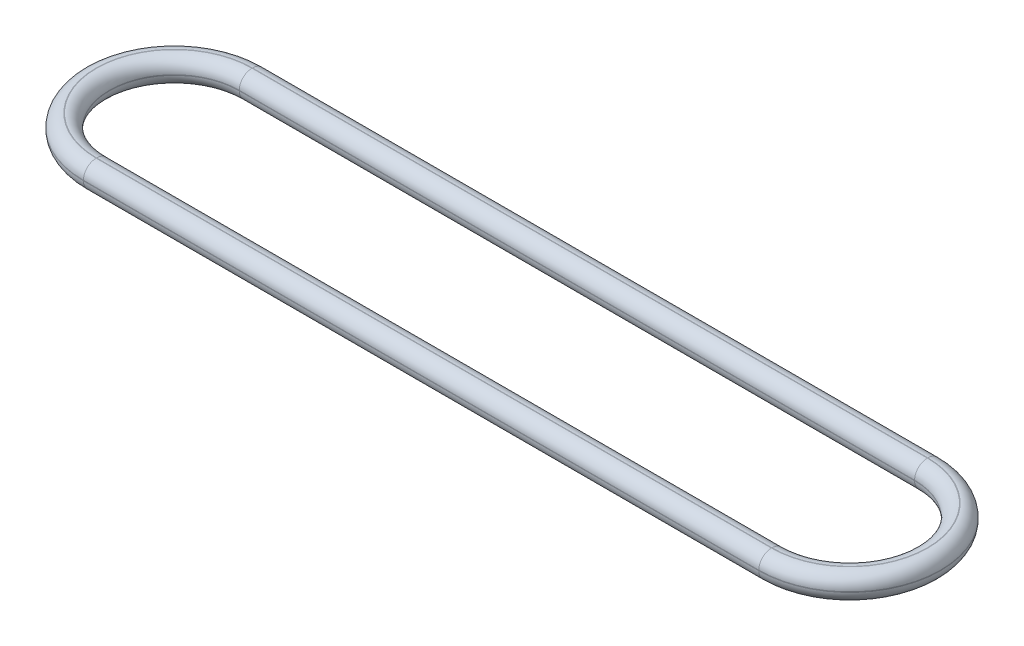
ISO-10303-21;
HEADER;
FILE_DESCRIPTION(('STEP AP214'),'2;1');
FILE_NAME('part.step','',(''),(''),'','','');
FILE_SCHEMA(('AUTOMOTIVE_DESIGN { 1 0 10303 214 1 1 1 1 }'));
ENDSEC;
DATA;
#1=APPLICATION_CONTEXT('core data for automotive mechanical design processes');
#2=APPLICATION_PROTOCOL_DEFINITION('international standard','automotive_design',2000,#1);
#3=PRODUCT_CONTEXT('',#1,'mechanical');
#4=PRODUCT('Part','Part','',(#3));
#5=PRODUCT_RELATED_PRODUCT_CATEGORY('part','',(#4));
#6=PRODUCT_DEFINITION_FORMATION('','',#4);
#7=PRODUCT_DEFINITION_CONTEXT('part definition',#1,'design');
#8=PRODUCT_DEFINITION('design','',#6,#7);
#9=PRODUCT_DEFINITION_SHAPE('','',#8);
#10=(LENGTH_UNIT() NAMED_UNIT(*) SI_UNIT(.MILLI.,.METRE.));
#11=(NAMED_UNIT(*) PLANE_ANGLE_UNIT() SI_UNIT($,.RADIAN.));
#12=(NAMED_UNIT(*) SI_UNIT($,.STERADIAN.) SOLID_ANGLE_UNIT());
#13=UNCERTAINTY_MEASURE_WITH_UNIT(LENGTH_MEASURE(1.E-05),#10,'distance_accuracy_value','');
#14=(GEOMETRIC_REPRESENTATION_CONTEXT(3) GLOBAL_UNCERTAINTY_ASSIGNED_CONTEXT((#13)) GLOBAL_UNIT_ASSIGNED_CONTEXT((#10,
#11,#12)) REPRESENTATION_CONTEXT('',''));
#15=CARTESIAN_POINT('',(0.,0.,0.));
#16=DIRECTION('',(0.,0.,1.));
#17=DIRECTION('',(1.,0.,0.));
#18=AXIS2_PLACEMENT_3D('',#15,#16,#17);
#19=CARTESIAN_POINT('',(0.,1.,0.));
#20=DIRECTION('',(0.,1.,0.));
#21=DIRECTION('',(0.,0.,1.));
#22=AXIS2_PLACEMENT_3D('',#19,#20,#21);
#23=PLANE('',#22);
#24=DIRECTION('',(-1.,0.,0.));
#25=VECTOR('',#24,1.);
#26=CARTESIAN_POINT('',(0.,1.,-2.99));
#27=LINE('',#26,#25);
#28=CARTESIAN_POINT('',(0.,1.,-2.99));
#29=VERTEX_POINT('',#28);
#30=CARTESIAN_POINT('',(26.,1.,-2.99));
#31=VERTEX_POINT('',#30);
#32=EDGE_CURVE('E52',#29,#31,#27,.F.);
#33=ORIENTED_EDGE('',*,*,#32,.T.);
#34=CARTESIAN_POINT('',(26.,1.,0.));
#35=DIRECTION('',(0.,1.,0.));
#36=DIRECTION('',(0.,0.,1.));
#37=AXIS2_PLACEMENT_3D('',#34,#35,#36);
#38=CIRCLE('',#37,2.99);
#39=CARTESIAN_POINT('',(26.,1.,2.99));
#40=VERTEX_POINT('',#39);
#41=EDGE_CURVE('E237',#31,#40,#38,.F.);
#42=ORIENTED_EDGE('',*,*,#41,.T.);
#43=DIRECTION('',(1.,0.,0.));
#44=VECTOR('',#43,1.);
#45=CARTESIAN_POINT('',(0.,1.,2.99));
#46=LINE('',#45,#44);
#47=CARTESIAN_POINT('',(0.,1.,2.99));
#48=VERTEX_POINT('',#47);
#49=EDGE_CURVE('E233',#40,#48,#46,.F.);
#50=ORIENTED_EDGE('',*,*,#49,.T.);
#51=CARTESIAN_POINT('',(0.,1.,0.));
#52=DIRECTION('',(0.,1.,0.));
#53=DIRECTION('',(0.,0.,1.));
#54=AXIS2_PLACEMENT_3D('',#51,#52,#53);
#55=CIRCLE('',#54,2.99);
#56=EDGE_CURVE('E57',#48,#29,#55,.F.);
#57=ORIENTED_EDGE('',*,*,#56,.T.);
#58=EDGE_LOOP('',(#33,#42,#50,#57));
#59=FACE_BOUND('',#58,.T.);
#60=CARTESIAN_POINT('',(26.,1.,0.));
#61=DIRECTION('',(0.,1.,0.));
#62=DIRECTION('',(0.,0.,1.));
#63=AXIS2_PLACEMENT_3D('',#60,#61,#62);
#64=CIRCLE('',#63,3.01);
#65=CARTESIAN_POINT('',(26.,1.,3.01000000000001));
#66=VERTEX_POINT('',#65);
#67=CARTESIAN_POINT('',(26.,1.,-3.01));
#68=VERTEX_POINT('',#67);
#69=EDGE_CURVE('E228',#66,#68,#64,.T.);
#70=ORIENTED_EDGE('',*,*,#69,.T.);
#71=DIRECTION('',(-1.,0.,0.));
#72=VECTOR('',#71,1.);
#73=CARTESIAN_POINT('',(0.,1.,-3.01));
#74=LINE('',#73,#72);
#75=CARTESIAN_POINT('',(0.,1.,-3.01));
#76=VERTEX_POINT('',#75);
#77=EDGE_CURVE('E230',#68,#76,#74,.T.);
#78=ORIENTED_EDGE('',*,*,#77,.T.);
#79=CARTESIAN_POINT('',(0.,1.,0.));
#80=DIRECTION('',(0.,1.,0.));
#81=DIRECTION('',(0.,0.,1.));
#82=AXIS2_PLACEMENT_3D('',#79,#80,#81);
#83=CIRCLE('',#82,3.01);
#84=CARTESIAN_POINT('',(0.,1.,3.01));
#85=VERTEX_POINT('',#84);
#86=EDGE_CURVE('E224',#76,#85,#83,.T.);
#87=ORIENTED_EDGE('',*,*,#86,.T.);
#88=DIRECTION('',(1.,0.,0.));
#89=VECTOR('',#88,1.);
#90=CARTESIAN_POINT('',(26.,1.,3.01000000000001));
#91=LINE('',#90,#89);
#92=EDGE_CURVE('E226',#85,#66,#91,.T.);
#93=ORIENTED_EDGE('',*,*,#92,.T.);
#94=EDGE_LOOP('',(#70,#78,#87,#93));
#95=FACE_BOUND('',#94,.T.);
#96=ADVANCED_FACE('F35',(#59,#95),#23,.T.);
#97=CARTESIAN_POINT('',(0.,0.,0.));
#98=DIRECTION('',(0.,1.,0.));
#99=DIRECTION('',(0.,0.,1.));
#100=AXIS2_PLACEMENT_3D('',#97,#98,#99);
#101=PLANE('',#100);
#102=DIRECTION('',(-1.,0.,0.));
#103=VECTOR('',#102,1.);
#104=CARTESIAN_POINT('',(0.,0.,-2.99));
#105=LINE('',#104,#103);
#106=CARTESIAN_POINT('',(26.,0.,-2.99));
#107=VERTEX_POINT('',#106);
#108=CARTESIAN_POINT('',(0.,0.,-2.99));
#109=VERTEX_POINT('',#108);
#110=EDGE_CURVE('E188',#107,#109,#105,.T.);
#111=ORIENTED_EDGE('',*,*,#110,.T.);
#112=CARTESIAN_POINT('',(0.,0.,0.));
#113=DIRECTION('',(0.,1.,0.));
#114=DIRECTION('',(0.,0.,1.));
#115=AXIS2_PLACEMENT_3D('',#112,#113,#114);
#116=CIRCLE('',#115,2.99);
#117=CARTESIAN_POINT('',(0.,0.,2.99));
#118=VERTEX_POINT('',#117);
#119=EDGE_CURVE('E190',#109,#118,#116,.T.);
#120=ORIENTED_EDGE('',*,*,#119,.T.);
#121=DIRECTION('',(1.,0.,0.));
#122=VECTOR('',#121,1.);
#123=CARTESIAN_POINT('',(26.,0.,2.99));
#124=LINE('',#123,#122);
#125=CARTESIAN_POINT('',(26.,0.,2.99));
#126=VERTEX_POINT('',#125);
#127=EDGE_CURVE('E184',#118,#126,#124,.T.);
#128=ORIENTED_EDGE('',*,*,#127,.T.);
#129=CARTESIAN_POINT('',(26.,0.,0.));
#130=DIRECTION('',(0.,1.,0.));
#131=DIRECTION('',(0.,0.,1.));
#132=AXIS2_PLACEMENT_3D('',#129,#130,#131);
#133=CIRCLE('',#132,2.99);
#134=EDGE_CURVE('E186',#126,#107,#133,.T.);
#135=ORIENTED_EDGE('',*,*,#134,.T.);
#136=EDGE_LOOP('',(#111,#120,#128,#135));
#137=FACE_BOUND('',#136,.T.);
#138=CARTESIAN_POINT('',(26.,0.,0.));
#139=DIRECTION('',(0.,1.,0.));
#140=DIRECTION('',(0.,0.,1.));
#141=AXIS2_PLACEMENT_3D('',#138,#139,#140);
#142=CIRCLE('',#141,3.01);
#143=CARTESIAN_POINT('',(26.,0.,-3.01));
#144=VERTEX_POINT('',#143);
#145=CARTESIAN_POINT('',(26.,0.,3.01000000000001));
#146=VERTEX_POINT('',#145);
#147=EDGE_CURVE('E153',#144,#146,#142,.F.);
#148=ORIENTED_EDGE('',*,*,#147,.T.);
#149=DIRECTION('',(1.,0.,0.));
#150=VECTOR('',#149,1.);
#151=CARTESIAN_POINT('',(0.,0.,3.01));
#152=LINE('',#151,#150);
#153=CARTESIAN_POINT('',(0.,0.,3.01));
#154=VERTEX_POINT('',#153);
#155=EDGE_CURVE('E182',#146,#154,#152,.F.);
#156=ORIENTED_EDGE('',*,*,#155,.T.);
#157=CARTESIAN_POINT('',(0.,0.,0.));
#158=DIRECTION('',(0.,1.,0.));
#159=DIRECTION('',(0.,0.,1.));
#160=AXIS2_PLACEMENT_3D('',#157,#158,#159);
#161=CIRCLE('',#160,3.01);
#162=CARTESIAN_POINT('',(0.,0.,-3.01));
#163=VERTEX_POINT('',#162);
#164=EDGE_CURVE('E156',#154,#163,#161,.F.);
#165=ORIENTED_EDGE('',*,*,#164,.T.);
#166=DIRECTION('',(-1.,0.,0.));
#167=VECTOR('',#166,1.);
#168=CARTESIAN_POINT('',(0.,0.,-3.01));
#169=LINE('',#168,#167);
#170=EDGE_CURVE('E148',#163,#144,#169,.F.);
#171=ORIENTED_EDGE('',*,*,#170,.T.);
#172=EDGE_LOOP('',(#148,#156,#165,#171));
#173=FACE_BOUND('',#172,.T.);
#174=ADVANCED_FACE('F150',(#137,#173),#101,.F.);
#175=CARTESIAN_POINT('',(0.,1.,0.));
#176=DIRECTION('',(0.,-1.,0.));
#177=DIRECTION('',(0.,0.,-1.));
#178=AXIS2_PLACEMENT_3D('',#175,#176,#177);
#179=CYLINDRICAL_SURFACE('',#178,3.5);
#180=DIRECTION('',(0.,-1.,0.));
#181=VECTOR('',#180,1.);
#182=CARTESIAN_POINT('',(0.,1.,-3.5));
#183=LINE('',#182,#181);
#184=CARTESIAN_POINT('',(0.,0.51,-3.5));
#185=VERTEX_POINT('',#184);
#186=CARTESIAN_POINT('',(0.,0.49,-3.5));
#187=VERTEX_POINT('',#186);
#188=EDGE_CURVE('E294',#185,#187,#183,.T.);
#189=ORIENTED_EDGE('',*,*,#188,.T.);
#190=CARTESIAN_POINT('',(0.,0.49,0.));
#191=DIRECTION('',(0.,1.,0.));
#192=DIRECTION('',(0.,0.,1.));
#193=AXIS2_PLACEMENT_3D('',#190,#191,#192);
#194=CIRCLE('',#193,3.5);
#195=CARTESIAN_POINT('',(0.,0.49,3.5));
#196=VERTEX_POINT('',#195);
#197=EDGE_CURVE('E214',#187,#196,#194,.T.);
#198=ORIENTED_EDGE('',*,*,#197,.T.);
#199=DIRECTION('',(0.,-1.,0.));
#200=VECTOR('',#199,1.);
#201=CARTESIAN_POINT('',(0.,1.,3.5));
#202=LINE('',#201,#200);
#203=CARTESIAN_POINT('',(0.,0.51,3.5));
#204=VERTEX_POINT('',#203);
#205=EDGE_CURVE('E174',#204,#196,#202,.T.);
#206=ORIENTED_EDGE('',*,*,#205,.F.);
#207=CARTESIAN_POINT('',(0.,0.51,0.));
#208=DIRECTION('',(0.,1.,0.));
#209=DIRECTION('',(0.,0.,1.));
#210=AXIS2_PLACEMENT_3D('',#207,#208,#209);
#211=CIRCLE('',#210,3.5);
#212=EDGE_CURVE('E212',#204,#185,#211,.F.);
#213=ORIENTED_EDGE('',*,*,#212,.T.);
#214=EDGE_LOOP('',(#189,#198,#206,#213));
#215=FACE_BOUND('',#214,.T.);
#216=ADVANCED_FACE('F291',(#215),#179,.T.);
#217=CARTESIAN_POINT('',(26.,1.,3.50000000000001));
#218=DIRECTION('',(0.,0.,-1.));
#219=DIRECTION('',(-1.,0.,0.));
#220=AXIS2_PLACEMENT_3D('',#217,#218,#219);
#221=PLANE('',#220);
#222=ORIENTED_EDGE('',*,*,#205,.T.);
#223=DIRECTION('',(1.,0.,0.));
#224=VECTOR('',#223,1.);
#225=CARTESIAN_POINT('',(26.,0.49,3.50000000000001));
#226=LINE('',#225,#224);
#227=CARTESIAN_POINT('',(26.,0.49,3.50000000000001));
#228=VERTEX_POINT('',#227);
#229=EDGE_CURVE('E209',#196,#228,#226,.T.);
#230=ORIENTED_EDGE('',*,*,#229,.T.);
#231=DIRECTION('',(0.,-1.,0.));
#232=VECTOR('',#231,1.);
#233=CARTESIAN_POINT('',(26.,1.,3.50000000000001));
#234=LINE('',#233,#232);
#235=CARTESIAN_POINT('',(26.,0.51,3.50000000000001));
#236=VERTEX_POINT('',#235);
#237=EDGE_CURVE('E177',#236,#228,#234,.T.);
#238=ORIENTED_EDGE('',*,*,#237,.F.);
#239=DIRECTION('',(1.,0.,0.));
#240=VECTOR('',#239,1.);
#241=CARTESIAN_POINT('',(0.,0.51,3.5));
#242=LINE('',#241,#240);
#243=EDGE_CURVE('E207',#236,#204,#242,.F.);
#244=ORIENTED_EDGE('',*,*,#243,.T.);
#245=EDGE_LOOP('',(#222,#230,#238,#244));
#246=FACE_BOUND('',#245,.T.);
#247=ADVANCED_FACE('F286',(#246),#221,.F.);
#248=CARTESIAN_POINT('',(26.,1.,0.));
#249=DIRECTION('',(0.,-1.,0.));
#250=DIRECTION('',(0.,0.,-1.));
#251=AXIS2_PLACEMENT_3D('',#248,#249,#250);
#252=CYLINDRICAL_SURFACE('',#251,3.5);
#253=DIRECTION('',(0.,-1.,0.));
#254=VECTOR('',#253,1.);
#255=CARTESIAN_POINT('',(26.,1.,-3.5));
#256=LINE('',#255,#254);
#257=CARTESIAN_POINT('',(26.,0.51,-3.5));
#258=VERTEX_POINT('',#257);
#259=CARTESIAN_POINT('',(26.,0.49,-3.5));
#260=VERTEX_POINT('',#259);
#261=EDGE_CURVE('E304',#258,#260,#256,.T.);
#262=ORIENTED_EDGE('',*,*,#261,.F.);
#263=CARTESIAN_POINT('',(26.,0.51,0.));
#264=DIRECTION('',(0.,1.,0.));
#265=DIRECTION('',(0.,0.,1.));
#266=AXIS2_PLACEMENT_3D('',#263,#264,#265);
#267=CIRCLE('',#266,3.5);
#268=EDGE_CURVE('E11',#258,#236,#267,.F.);
#269=ORIENTED_EDGE('',*,*,#268,.T.);
#270=ORIENTED_EDGE('',*,*,#237,.T.);
#271=CARTESIAN_POINT('',(26.,0.49,0.));
#272=DIRECTION('',(0.,1.,0.));
#273=DIRECTION('',(0.,0.,1.));
#274=AXIS2_PLACEMENT_3D('',#271,#272,#273);
#275=CIRCLE('',#274,3.5);
#276=EDGE_CURVE('E44',#228,#260,#275,.T.);
#277=ORIENTED_EDGE('',*,*,#276,.T.);
#278=EDGE_LOOP('',(#262,#269,#270,#277));
#279=FACE_BOUND('',#278,.T.);
#280=ADVANCED_FACE('F302',(#279),#252,.T.);
#281=CARTESIAN_POINT('',(0.,1.,-3.5));
#282=DIRECTION('',(0.,0.,1.));
#283=DIRECTION('',(1.,0.,0.));
#284=AXIS2_PLACEMENT_3D('',#281,#282,#283);
#285=PLANE('',#284);
#286=ORIENTED_EDGE('',*,*,#261,.T.);
#287=DIRECTION('',(-1.,0.,0.));
#288=VECTOR('',#287,1.);
#289=CARTESIAN_POINT('',(0.,0.49,-3.5));
#290=LINE('',#289,#288);
#291=EDGE_CURVE('E165',#260,#187,#290,.T.);
#292=ORIENTED_EDGE('',*,*,#291,.T.);
#293=ORIENTED_EDGE('',*,*,#188,.F.);
#294=DIRECTION('',(-1.,0.,0.));
#295=VECTOR('',#294,1.);
#296=CARTESIAN_POINT('',(26.,0.51,-3.5));
#297=LINE('',#296,#295);
#298=EDGE_CURVE('E216',#185,#258,#297,.F.);
#299=ORIENTED_EDGE('',*,*,#298,.T.);
#300=EDGE_LOOP('',(#286,#292,#293,#299));
#301=FACE_BOUND('',#300,.T.);
#302=ADVANCED_FACE('F386',(#301),#285,.F.);
#303=CARTESIAN_POINT('',(0.,1.,0.));
#304=DIRECTION('',(0.,-1.,0.));
#305=DIRECTION('',(0.,0.,-1.));
#306=AXIS2_PLACEMENT_3D('',#303,#304,#305);
#307=CYLINDRICAL_SURFACE('',#306,2.5);
#308=DIRECTION('',(0.,-1.,0.));
#309=VECTOR('',#308,1.);
#310=CARTESIAN_POINT('',(0.,1.,2.5));
#311=LINE('',#310,#309);
#312=CARTESIAN_POINT('',(0.,0.51,2.5));
#313=VERTEX_POINT('',#312);
#314=CARTESIAN_POINT('',(0.,0.49,2.5));
#315=VERTEX_POINT('',#314);
#316=EDGE_CURVE('E308',#313,#315,#311,.T.);
#317=ORIENTED_EDGE('',*,*,#316,.T.);
#318=CARTESIAN_POINT('',(0.,0.49,0.));
#319=DIRECTION('',(0.,1.,0.));
#320=DIRECTION('',(0.,0.,1.));
#321=AXIS2_PLACEMENT_3D('',#318,#319,#320);
#322=CIRCLE('',#321,2.5);
#323=CARTESIAN_POINT('',(0.,0.49,-2.5));
#324=VERTEX_POINT('',#323);
#325=EDGE_CURVE('E195',#315,#324,#322,.F.);
#326=ORIENTED_EDGE('',*,*,#325,.T.);
#327=DIRECTION('',(0.,-1.,0.));
#328=VECTOR('',#327,1.);
#329=CARTESIAN_POINT('',(0.,1.,-2.5));
#330=LINE('',#329,#328);
#331=CARTESIAN_POINT('',(0.,0.51,-2.5));
#332=VERTEX_POINT('',#331);
#333=EDGE_CURVE('E250',#332,#324,#330,.T.);
#334=ORIENTED_EDGE('',*,*,#333,.F.);
#335=CARTESIAN_POINT('',(0.,0.51,0.));
#336=DIRECTION('',(0.,1.,0.));
#337=DIRECTION('',(0.,0.,1.));
#338=AXIS2_PLACEMENT_3D('',#335,#336,#337);
#339=CIRCLE('',#338,2.5);
#340=EDGE_CURVE('E193',#332,#313,#339,.T.);
#341=ORIENTED_EDGE('',*,*,#340,.T.);
#342=EDGE_LOOP('',(#317,#326,#334,#341));
#343=FACE_BOUND('',#342,.T.);
#344=ADVANCED_FACE('F326',(#343),#307,.F.);
#345=CARTESIAN_POINT('',(26.,1.,2.5));
#346=DIRECTION('',(0.,0.,-1.));
#347=DIRECTION('',(-1.,0.,0.));
#348=AXIS2_PLACEMENT_3D('',#345,#346,#347);
#349=PLANE('',#348);
#350=DIRECTION('',(0.,-1.,0.));
#351=VECTOR('',#350,1.);
#352=CARTESIAN_POINT('',(26.,1.,2.5));
#353=LINE('',#352,#351);
#354=CARTESIAN_POINT('',(26.,0.51,2.5));
#355=VERTEX_POINT('',#354);
#356=CARTESIAN_POINT('',(26.,0.49,2.5));
#357=VERTEX_POINT('',#356);
#358=EDGE_CURVE('E311',#355,#357,#353,.T.);
#359=ORIENTED_EDGE('',*,*,#358,.T.);
#360=DIRECTION('',(1.,0.,0.));
#361=VECTOR('',#360,1.);
#362=CARTESIAN_POINT('',(0.,0.49,2.5));
#363=LINE('',#362,#361);
#364=EDGE_CURVE('E222',#357,#315,#363,.F.);
#365=ORIENTED_EDGE('',*,*,#364,.T.);
#366=ORIENTED_EDGE('',*,*,#316,.F.);
#367=DIRECTION('',(1.,0.,0.));
#368=VECTOR('',#367,1.);
#369=CARTESIAN_POINT('',(26.,0.51,2.5));
#370=LINE('',#369,#368);
#371=EDGE_CURVE('E220',#313,#355,#370,.T.);
#372=ORIENTED_EDGE('',*,*,#371,.T.);
#373=EDGE_LOOP('',(#359,#365,#366,#372));
#374=FACE_BOUND('',#373,.T.);
#375=ADVANCED_FACE('F346',(#374),#349,.T.);
#376=CARTESIAN_POINT('',(26.,1.,0.));
#377=DIRECTION('',(0.,-1.,0.));
#378=DIRECTION('',(0.,0.,-1.));
#379=AXIS2_PLACEMENT_3D('',#376,#377,#378);
#380=CYLINDRICAL_SURFACE('',#379,2.5);
#381=DIRECTION('',(0.,-1.,0.));
#382=VECTOR('',#381,1.);
#383=CARTESIAN_POINT('',(26.,1.,-2.5));
#384=LINE('',#383,#382);
#385=CARTESIAN_POINT('',(26.,0.51,-2.5));
#386=VERTEX_POINT('',#385);
#387=CARTESIAN_POINT('',(26.,0.49,-2.5));
#388=VERTEX_POINT('',#387);
#389=EDGE_CURVE('E314',#386,#388,#384,.T.);
#390=ORIENTED_EDGE('',*,*,#389,.T.);
#391=CARTESIAN_POINT('',(26.,0.49,0.));
#392=DIRECTION('',(0.,1.,0.));
#393=DIRECTION('',(0.,0.,1.));
#394=AXIS2_PLACEMENT_3D('',#391,#392,#393);
#395=CIRCLE('',#394,2.5);
#396=EDGE_CURVE('E205',#388,#357,#395,.F.);
#397=ORIENTED_EDGE('',*,*,#396,.T.);
#398=ORIENTED_EDGE('',*,*,#358,.F.);
#399=CARTESIAN_POINT('',(26.,0.51,0.));
#400=DIRECTION('',(0.,1.,0.));
#401=DIRECTION('',(0.,0.,1.));
#402=AXIS2_PLACEMENT_3D('',#399,#400,#401);
#403=CIRCLE('',#402,2.5);
#404=EDGE_CURVE('E202',#355,#386,#403,.T.);
#405=ORIENTED_EDGE('',*,*,#404,.T.);
#406=EDGE_LOOP('',(#390,#397,#398,#405));
#407=FACE_BOUND('',#406,.T.);
#408=ADVANCED_FACE('F349',(#407),#380,.F.);
#409=CARTESIAN_POINT('',(0.,1.,-2.5));
#410=DIRECTION('',(0.,0.,1.));
#411=DIRECTION('',(1.,0.,0.));
#412=AXIS2_PLACEMENT_3D('',#409,#410,#411);
#413=PLANE('',#412);
#414=ORIENTED_EDGE('',*,*,#333,.T.);
#415=DIRECTION('',(-1.,0.,0.));
#416=VECTOR('',#415,1.);
#417=CARTESIAN_POINT('',(26.,0.49,-2.5));
#418=LINE('',#417,#416);
#419=EDGE_CURVE('E200',#324,#388,#418,.F.);
#420=ORIENTED_EDGE('',*,*,#419,.T.);
#421=ORIENTED_EDGE('',*,*,#389,.F.);
#422=DIRECTION('',(-1.,0.,0.));
#423=VECTOR('',#422,1.);
#424=CARTESIAN_POINT('',(0.,0.51,-2.5));
#425=LINE('',#424,#423);
#426=EDGE_CURVE('E198',#386,#332,#425,.T.);
#427=ORIENTED_EDGE('',*,*,#426,.T.);
#428=EDGE_LOOP('',(#414,#420,#421,#427));
#429=FACE_BOUND('',#428,.T.);
#430=ADVANCED_FACE('F320',(#429),#413,.T.);
#431=CARTESIAN_POINT('',(26.,0.49,0.));
#432=DIRECTION('',(0.,1.,0.));
#433=DIRECTION('',(0.,0.,1.));
#434=AXIS2_PLACEMENT_3D('',#431,#432,#433);
#435=TOROIDAL_SURFACE('',#434,2.99,0.49);
#436=CARTESIAN_POINT('',(26.,0.49,2.99));
#437=DIRECTION('',(-1.,0.,0.));
#438=DIRECTION('',(0.,0.,1.));
#439=AXIS2_PLACEMENT_3D('',#436,#437,#438);
#440=CIRCLE('',#439,0.49);
#441=EDGE_CURVE('E244',#357,#126,#440,.T.);
#442=ORIENTED_EDGE('',*,*,#441,.F.);
#443=ORIENTED_EDGE('',*,*,#396,.F.);
#444=CARTESIAN_POINT('',(26.,0.49,-2.99));
#445=DIRECTION('',(-1.,0.,0.));
#446=DIRECTION('',(0.,0.,1.));
#447=AXIS2_PLACEMENT_3D('',#444,#445,#446);
#448=CIRCLE('',#447,0.49);
#449=EDGE_CURVE('E247',#107,#388,#448,.T.);
#450=ORIENTED_EDGE('',*,*,#449,.F.);
#451=ORIENTED_EDGE('',*,*,#134,.F.);
#452=EDGE_LOOP('',(#442,#443,#450,#451));
#453=FACE_BOUND('',#452,.T.);
#454=ADVANCED_FACE('F353',(#453),#435,.T.);
#455=CARTESIAN_POINT('',(0.,0.49,-2.99));
#456=DIRECTION('',(1.,0.,0.));
#457=DIRECTION('',(0.,0.,-1.));
#458=AXIS2_PLACEMENT_3D('',#455,#456,#457);
#459=CYLINDRICAL_SURFACE('',#458,0.49);
#460=ORIENTED_EDGE('',*,*,#449,.T.);
#461=ORIENTED_EDGE('',*,*,#419,.F.);
#462=CARTESIAN_POINT('',(0.,0.49,-2.99));
#463=DIRECTION('',(-1.,0.,0.));
#464=DIRECTION('',(0.,0.,1.));
#465=AXIS2_PLACEMENT_3D('',#462,#463,#464);
#466=CIRCLE('',#465,0.49);
#467=EDGE_CURVE('E242',#109,#324,#466,.T.);
#468=ORIENTED_EDGE('',*,*,#467,.F.);
#469=ORIENTED_EDGE('',*,*,#110,.F.);
#470=EDGE_LOOP('',(#460,#461,#468,#469));
#471=FACE_BOUND('',#470,.T.);
#472=ADVANCED_FACE('F358',(#471),#459,.T.);
#473=CARTESIAN_POINT('',(0.,0.49,2.99));
#474=DIRECTION('',(-1.,0.,0.));
#475=DIRECTION('',(0.,0.,1.));
#476=AXIS2_PLACEMENT_3D('',#473,#474,#475);
#477=CYLINDRICAL_SURFACE('',#476,0.49);
#478=ORIENTED_EDGE('',*,*,#441,.T.);
#479=ORIENTED_EDGE('',*,*,#127,.F.);
#480=CARTESIAN_POINT('',(0.,0.49,2.99));
#481=DIRECTION('',(-1.,0.,0.));
#482=DIRECTION('',(0.,0.,1.));
#483=AXIS2_PLACEMENT_3D('',#480,#481,#482);
#484=CIRCLE('',#483,0.49);
#485=EDGE_CURVE('E240',#315,#118,#484,.T.);
#486=ORIENTED_EDGE('',*,*,#485,.F.);
#487=ORIENTED_EDGE('',*,*,#364,.F.);
#488=EDGE_LOOP('',(#478,#479,#486,#487));
#489=FACE_BOUND('',#488,.T.);
#490=ADVANCED_FACE('F364',(#489),#477,.T.);
#491=CARTESIAN_POINT('',(0.,0.49,0.));
#492=DIRECTION('',(0.,1.,0.));
#493=DIRECTION('',(0.,0.,1.));
#494=AXIS2_PLACEMENT_3D('',#491,#492,#493);
#495=TOROIDAL_SURFACE('',#494,2.99,0.49);
#496=ORIENTED_EDGE('',*,*,#467,.T.);
#497=ORIENTED_EDGE('',*,*,#325,.F.);
#498=ORIENTED_EDGE('',*,*,#485,.T.);
#499=ORIENTED_EDGE('',*,*,#119,.F.);
#500=EDGE_LOOP('',(#496,#497,#498,#499));
#501=FACE_BOUND('',#500,.T.);
#502=ADVANCED_FACE('F367',(#501),#495,.T.);
#503=CARTESIAN_POINT('',(0.,0.49,-3.01));
#504=DIRECTION('',(-1.,0.,0.));
#505=DIRECTION('',(0.,0.,1.));
#506=AXIS2_PLACEMENT_3D('',#503,#504,#505);
#507=CYLINDRICAL_SURFACE('',#506,0.49);
#508=CARTESIAN_POINT('',(26.,0.49,-3.01));
#509=DIRECTION('',(1.,0.,0.));
#510=DIRECTION('',(0.,0.,-1.));
#511=AXIS2_PLACEMENT_3D('',#508,#509,#510);
#512=CIRCLE('',#511,0.49);
#513=EDGE_CURVE('E163',#144,#260,#512,.T.);
#514=ORIENTED_EDGE('',*,*,#513,.F.);
#515=ORIENTED_EDGE('',*,*,#170,.F.);
#516=CARTESIAN_POINT('',(0.,0.49,-3.01));
#517=DIRECTION('',(-1.,0.,0.));
#518=DIRECTION('',(0.,0.,1.));
#519=AXIS2_PLACEMENT_3D('',#516,#517,#518);
#520=CIRCLE('',#519,0.49);
#521=EDGE_CURVE('E168',#187,#163,#520,.T.);
#522=ORIENTED_EDGE('',*,*,#521,.F.);
#523=ORIENTED_EDGE('',*,*,#291,.F.);
#524=EDGE_LOOP('',(#514,#515,#522,#523));
#525=FACE_BOUND('',#524,.T.);
#526=ADVANCED_FACE('F164',(#525),#507,.T.);
#527=CARTESIAN_POINT('',(0.,0.49,0.));
#528=DIRECTION('',(0.,1.,0.));
#529=DIRECTION('',(0.,0.,1.));
#530=AXIS2_PLACEMENT_3D('',#527,#528,#529);
#531=TOROIDAL_SURFACE('',#530,3.01,0.49);
#532=ORIENTED_EDGE('',*,*,#521,.T.);
#533=ORIENTED_EDGE('',*,*,#164,.F.);
#534=CARTESIAN_POINT('',(0.,0.49,3.01));
#535=DIRECTION('',(1.,0.,0.));
#536=DIRECTION('',(0.,1.,0.));
#537=AXIS2_PLACEMENT_3D('',#534,#535,#536);
#538=CIRCLE('',#537,0.49);
#539=EDGE_CURVE('E169',#196,#154,#538,.T.);
#540=ORIENTED_EDGE('',*,*,#539,.F.);
#541=ORIENTED_EDGE('',*,*,#197,.F.);
#542=EDGE_LOOP('',(#532,#533,#540,#541));
#543=FACE_BOUND('',#542,.T.);
#544=ADVANCED_FACE('F296',(#543),#531,.T.);
#545=CARTESIAN_POINT('',(26.,0.49,0.));
#546=DIRECTION('',(0.,1.,0.));
#547=DIRECTION('',(0.,0.,1.));
#548=AXIS2_PLACEMENT_3D('',#545,#546,#547);
#549=TOROIDAL_SURFACE('',#548,3.01,0.49);
#550=ORIENTED_EDGE('',*,*,#513,.T.);
#551=ORIENTED_EDGE('',*,*,#276,.F.);
#552=CARTESIAN_POINT('',(26.,0.49,3.01000000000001));
#553=DIRECTION('',(-1.,0.,0.));
#554=DIRECTION('',(0.,0.,1.));
#555=AXIS2_PLACEMENT_3D('',#552,#553,#554);
#556=CIRCLE('',#555,0.49);
#557=EDGE_CURVE('E173',#146,#228,#556,.T.);
#558=ORIENTED_EDGE('',*,*,#557,.F.);
#559=ORIENTED_EDGE('',*,*,#147,.F.);
#560=EDGE_LOOP('',(#550,#551,#558,#559));
#561=FACE_BOUND('',#560,.T.);
#562=ADVANCED_FACE('F172',(#561),#549,.T.);
#563=CARTESIAN_POINT('',(26.,0.49,3.01000000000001));
#564=DIRECTION('',(1.,0.,0.));
#565=DIRECTION('',(0.,0.,-1.));
#566=AXIS2_PLACEMENT_3D('',#563,#564,#565);
#567=CYLINDRICAL_SURFACE('',#566,0.49);
#568=ORIENTED_EDGE('',*,*,#539,.T.);
#569=ORIENTED_EDGE('',*,*,#155,.F.);
#570=ORIENTED_EDGE('',*,*,#557,.T.);
#571=ORIENTED_EDGE('',*,*,#229,.F.);
#572=EDGE_LOOP('',(#568,#569,#570,#571));
#573=FACE_BOUND('',#572,.T.);
#574=ADVANCED_FACE('F299',(#573),#567,.T.);
#575=CARTESIAN_POINT('',(0.,0.51,0.));
#576=DIRECTION('',(0.,1.,0.));
#577=DIRECTION('',(0.,0.,1.));
#578=AXIS2_PLACEMENT_3D('',#575,#576,#577);
#579=TOROIDAL_SURFACE('',#578,2.99,0.49);
#580=CARTESIAN_POINT('',(0.,0.51,-2.99));
#581=DIRECTION('',(1.,0.,0.));
#582=DIRECTION('',(0.,0.,-1.));
#583=AXIS2_PLACEMENT_3D('',#580,#581,#582);
#584=CIRCLE('',#583,0.49);
#585=EDGE_CURVE('E259',#29,#332,#584,.T.);
#586=ORIENTED_EDGE('',*,*,#585,.F.);
#587=ORIENTED_EDGE('',*,*,#56,.F.);
#588=CARTESIAN_POINT('',(0.,0.51,2.99));
#589=DIRECTION('',(1.,0.,0.));
#590=DIRECTION('',(0.,0.,-1.));
#591=AXIS2_PLACEMENT_3D('',#588,#589,#590);
#592=CIRCLE('',#591,0.49);
#593=EDGE_CURVE('E252',#313,#48,#592,.T.);
#594=ORIENTED_EDGE('',*,*,#593,.F.);
#595=ORIENTED_EDGE('',*,*,#340,.F.);
#596=EDGE_LOOP('',(#586,#587,#594,#595));
#597=FACE_BOUND('',#596,.T.);
#598=ADVANCED_FACE('F331',(#597),#579,.T.);
#599=CARTESIAN_POINT('',(26.,0.51,2.99));
#600=DIRECTION('',(1.,0.,0.));
#601=DIRECTION('',(0.,0.,-1.));
#602=AXIS2_PLACEMENT_3D('',#599,#600,#601);
#603=CYLINDRICAL_SURFACE('',#602,0.49);
#604=ORIENTED_EDGE('',*,*,#593,.T.);
#605=ORIENTED_EDGE('',*,*,#49,.F.);
#606=CARTESIAN_POINT('',(26.,0.51,2.99));
#607=DIRECTION('',(1.,0.,0.));
#608=DIRECTION('',(0.,0.,-1.));
#609=AXIS2_PLACEMENT_3D('',#606,#607,#608);
#610=CIRCLE('',#609,0.49);
#611=EDGE_CURVE('E257',#355,#40,#610,.T.);
#612=ORIENTED_EDGE('',*,*,#611,.F.);
#613=ORIENTED_EDGE('',*,*,#371,.F.);
#614=EDGE_LOOP('',(#604,#605,#612,#613));
#615=FACE_BOUND('',#614,.T.);
#616=ADVANCED_FACE('F343',(#615),#603,.T.);
#617=CARTESIAN_POINT('',(0.,0.51,-2.99));
#618=DIRECTION('',(-1.,0.,0.));
#619=DIRECTION('',(0.,0.,1.));
#620=AXIS2_PLACEMENT_3D('',#617,#618,#619);
#621=CYLINDRICAL_SURFACE('',#620,0.49);
#622=ORIENTED_EDGE('',*,*,#585,.T.);
#623=ORIENTED_EDGE('',*,*,#426,.F.);
#624=CARTESIAN_POINT('',(26.,0.51,-2.99));
#625=DIRECTION('',(1.,0.,0.));
#626=DIRECTION('',(0.,0.,-1.));
#627=AXIS2_PLACEMENT_3D('',#624,#625,#626);
#628=CIRCLE('',#627,0.49);
#629=EDGE_CURVE('E255',#31,#386,#628,.T.);
#630=ORIENTED_EDGE('',*,*,#629,.F.);
#631=ORIENTED_EDGE('',*,*,#32,.F.);
#632=EDGE_LOOP('',(#622,#623,#630,#631));
#633=FACE_BOUND('',#632,.T.);
#634=ADVANCED_FACE('F334',(#633),#621,.T.);
#635=CARTESIAN_POINT('',(26.,0.51,0.));
#636=DIRECTION('',(0.,1.,0.));
#637=DIRECTION('',(0.,0.,1.));
#638=AXIS2_PLACEMENT_3D('',#635,#636,#637);
#639=TOROIDAL_SURFACE('',#638,2.99,0.49);
#640=ORIENTED_EDGE('',*,*,#611,.T.);
#641=ORIENTED_EDGE('',*,*,#41,.F.);
#642=ORIENTED_EDGE('',*,*,#629,.T.);
#643=ORIENTED_EDGE('',*,*,#404,.F.);
#644=EDGE_LOOP('',(#640,#641,#642,#643));
#645=FACE_BOUND('',#644,.T.);
#646=ADVANCED_FACE('F338',(#645),#639,.T.);
#647=CARTESIAN_POINT('',(0.,0.51,3.01));
#648=DIRECTION('',(-1.,0.,0.));
#649=DIRECTION('',(0.,0.,1.));
#650=AXIS2_PLACEMENT_3D('',#647,#648,#649);
#651=CYLINDRICAL_SURFACE('',#650,0.49);
#652=CARTESIAN_POINT('',(0.,0.51,3.01));
#653=DIRECTION('',(-1.,0.,0.));
#654=DIRECTION('',(0.,0.,1.));
#655=AXIS2_PLACEMENT_3D('',#652,#653,#654);
#656=CIRCLE('',#655,0.49);
#657=EDGE_CURVE('E267',#204,#85,#656,.T.);
#658=ORIENTED_EDGE('',*,*,#657,.F.);
#659=ORIENTED_EDGE('',*,*,#243,.F.);
#660=CARTESIAN_POINT('',(26.,0.51,3.01000000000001));
#661=DIRECTION('',(1.,0.,0.));
#662=DIRECTION('',(0.,0.,-1.));
#663=AXIS2_PLACEMENT_3D('',#660,#661,#662);
#664=CIRCLE('',#663,0.49);
#665=EDGE_CURVE('E39',#66,#236,#664,.T.);
#666=ORIENTED_EDGE('',*,*,#665,.F.);
#667=ORIENTED_EDGE('',*,*,#92,.F.);
#668=EDGE_LOOP('',(#658,#659,#666,#667));
#669=FACE_BOUND('',#668,.T.);
#670=ADVANCED_FACE('F37',(#669),#651,.T.);
#671=CARTESIAN_POINT('',(26.,0.51,0.));
#672=DIRECTION('',(0.,1.,0.));
#673=DIRECTION('',(0.,0.,1.));
#674=AXIS2_PLACEMENT_3D('',#671,#672,#673);
#675=TOROIDAL_SURFACE('',#674,3.01,0.49);
#676=ORIENTED_EDGE('',*,*,#665,.T.);
#677=ORIENTED_EDGE('',*,*,#268,.F.);
#678=CARTESIAN_POINT('',(26.,0.51,-3.01));
#679=DIRECTION('',(-1.,0.,0.));
#680=DIRECTION('',(0.,0.,1.));
#681=AXIS2_PLACEMENT_3D('',#678,#679,#680);
#682=CIRCLE('',#681,0.49);
#683=EDGE_CURVE('E266',#68,#258,#682,.T.);
#684=ORIENTED_EDGE('',*,*,#683,.F.);
#685=ORIENTED_EDGE('',*,*,#69,.F.);
#686=EDGE_LOOP('',(#676,#677,#684,#685));
#687=FACE_BOUND('',#686,.T.);
#688=ADVANCED_FACE('F278',(#687),#675,.T.);
#689=CARTESIAN_POINT('',(0.,0.51,0.));
#690=DIRECTION('',(0.,1.,0.));
#691=DIRECTION('',(0.,0.,1.));
#692=AXIS2_PLACEMENT_3D('',#689,#690,#691);
#693=TOROIDAL_SURFACE('',#692,3.01,0.49);
#694=ORIENTED_EDGE('',*,*,#657,.T.);
#695=ORIENTED_EDGE('',*,*,#86,.F.);
#696=CARTESIAN_POINT('',(0.,0.51,-3.01));
#697=DIRECTION('',(1.,0.,0.));
#698=DIRECTION('',(0.,0.,-1.));
#699=AXIS2_PLACEMENT_3D('',#696,#697,#698);
#700=CIRCLE('',#699,0.49);
#701=EDGE_CURVE('E264',#185,#76,#700,.T.);
#702=ORIENTED_EDGE('',*,*,#701,.F.);
#703=ORIENTED_EDGE('',*,*,#212,.F.);
#704=EDGE_LOOP('',(#694,#695,#702,#703));
#705=FACE_BOUND('',#704,.T.);
#706=ADVANCED_FACE('F530',(#705),#693,.T.);
#707=CARTESIAN_POINT('',(0.,0.51,-3.01));
#708=DIRECTION('',(1.,0.,0.));
#709=DIRECTION('',(0.,0.,-1.));
#710=AXIS2_PLACEMENT_3D('',#707,#708,#709);
#711=CYLINDRICAL_SURFACE('',#710,0.49);
#712=ORIENTED_EDGE('',*,*,#683,.T.);
#713=ORIENTED_EDGE('',*,*,#298,.F.);
#714=ORIENTED_EDGE('',*,*,#701,.T.);
#715=ORIENTED_EDGE('',*,*,#77,.F.);
#716=EDGE_LOOP('',(#712,#713,#714,#715));
#717=FACE_BOUND('',#716,.T.);
#718=ADVANCED_FACE('F538',(#717),#711,.T.);
#719=CLOSED_SHELL('',(#96,#174,#216,#247,#280,#302,#344,#375,#408,#430,#454,#472,#490,#502,#526,
#544,#562,#574,#598,#616,#634,#646,#670,#688,#706,#718));
#720=MANIFOLD_SOLID_BREP('B2',#719);
#721=ADVANCED_BREP_SHAPE_REPRESENTATION('',(#18,#720),#14);
#722=SHAPE_DEFINITION_REPRESENTATION(#9,#721);
ENDSEC;
END-ISO-10303-21;
